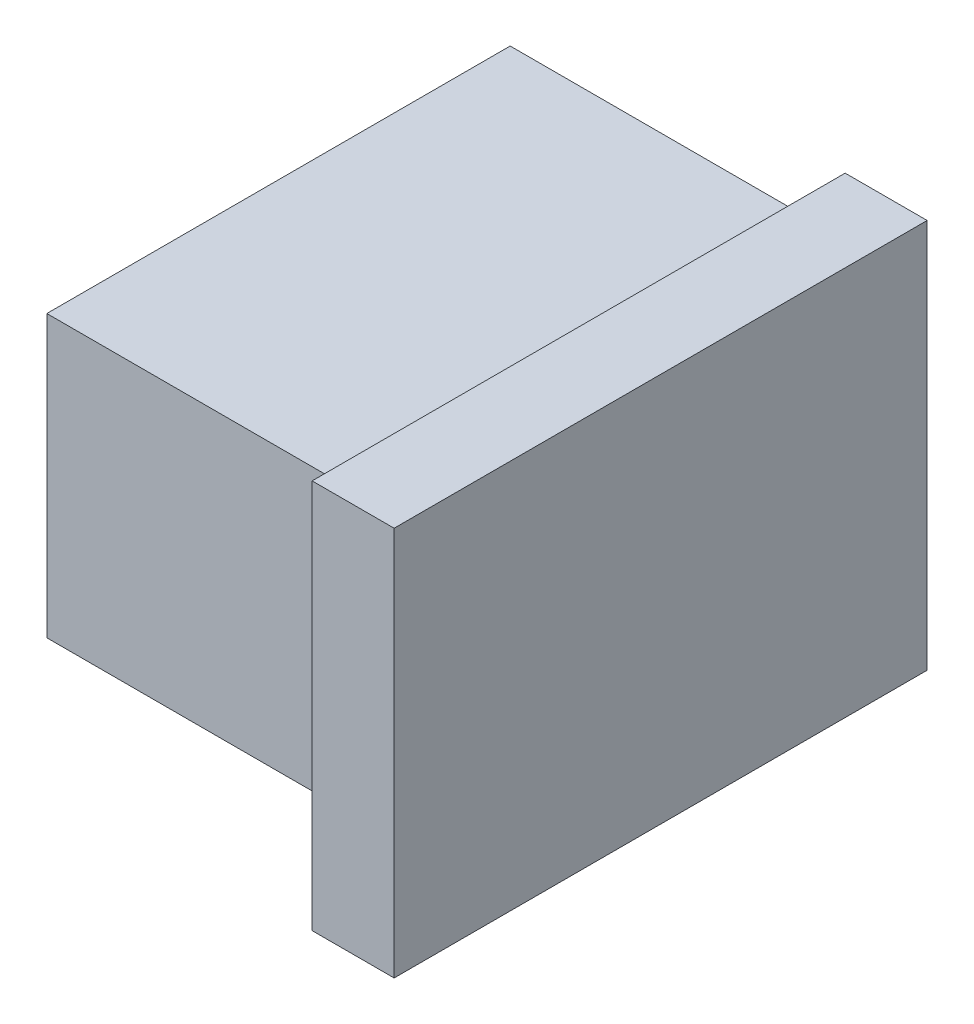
ISO-10303-21;
HEADER;
FILE_DESCRIPTION(('STEP AP214'),'2;1');
FILE_NAME('part.step','',(''),(''),'','','');
FILE_SCHEMA(('AUTOMOTIVE_DESIGN { 1 0 10303 214 1 1 1 1 }'));
ENDSEC;
DATA;
#1=APPLICATION_CONTEXT('core data for automotive mechanical design processes');
#2=APPLICATION_PROTOCOL_DEFINITION('international standard','automotive_design',2000,#1);
#3=PRODUCT_CONTEXT('',#1,'mechanical');
#4=PRODUCT('Part','Part','',(#3));
#5=PRODUCT_RELATED_PRODUCT_CATEGORY('part','',(#4));
#6=PRODUCT_DEFINITION_FORMATION('','',#4);
#7=PRODUCT_DEFINITION_CONTEXT('part definition',#1,'design');
#8=PRODUCT_DEFINITION('design','',#6,#7);
#9=PRODUCT_DEFINITION_SHAPE('','',#8);
#10=(LENGTH_UNIT() NAMED_UNIT(*) SI_UNIT(.MILLI.,.METRE.));
#11=(NAMED_UNIT(*) PLANE_ANGLE_UNIT() SI_UNIT($,.RADIAN.));
#12=(NAMED_UNIT(*) SI_UNIT($,.STERADIAN.) SOLID_ANGLE_UNIT());
#13=UNCERTAINTY_MEASURE_WITH_UNIT(LENGTH_MEASURE(1.E-05),#10,'distance_accuracy_value','');
#14=(GEOMETRIC_REPRESENTATION_CONTEXT(3) GLOBAL_UNCERTAINTY_ASSIGNED_CONTEXT((#13)) GLOBAL_UNIT_ASSIGNED_CONTEXT((#10,
#11,#12)) REPRESENTATION_CONTEXT('',''));
#15=CARTESIAN_POINT('',(0.,0.,0.));
#16=DIRECTION('',(0.,0.,1.));
#17=DIRECTION('',(1.,0.,0.));
#18=AXIS2_PLACEMENT_3D('',#15,#16,#17);
#19=CARTESIAN_POINT('',(7.32,0.,-5.65));
#20=DIRECTION('',(0.,0.,-1.));
#21=DIRECTION('',(0.,1.,0.));
#22=AXIS2_PLACEMENT_3D('',#19,#20,#21);
#23=PLANE('',#22);
#24=DIRECTION('',(-1.,0.,0.));
#25=VECTOR('',#24,1.);
#26=CARTESIAN_POINT('',(18.7258099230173,-2.65,-5.65));
#27=LINE('',#26,#25);
#28=CARTESIAN_POINT('',(7.32,-2.65,-5.65));
#29=VERTEX_POINT('',#28);
#30=CARTESIAN_POINT('',(0.,-2.65,-5.65));
#31=VERTEX_POINT('',#30);
#32=EDGE_CURVE('E128',#29,#31,#27,.T.);
#33=ORIENTED_EDGE('',*,*,#32,.T.);
#34=DIRECTION('',(0.,-1.,0.));
#35=VECTOR('',#34,1.);
#36=CARTESIAN_POINT('',(0.,0.,-5.65));
#37=LINE('',#36,#35);
#38=CARTESIAN_POINT('',(0.,4.2,-5.65));
#39=VERTEX_POINT('',#38);
#40=EDGE_CURVE('E135',#39,#31,#37,.T.);
#41=ORIENTED_EDGE('',*,*,#40,.F.);
#42=DIRECTION('',(-1.,0.,0.));
#43=VECTOR('',#42,1.);
#44=CARTESIAN_POINT('',(7.32,4.2,-5.65));
#45=LINE('',#44,#43);
#46=CARTESIAN_POINT('',(7.32,4.2,-5.65));
#47=VERTEX_POINT('',#46);
#48=EDGE_CURVE('E11',#47,#39,#45,.T.);
#49=ORIENTED_EDGE('',*,*,#48,.F.);
#50=DIRECTION('',(0.,-1.,0.));
#51=VECTOR('',#50,1.);
#52=CARTESIAN_POINT('',(7.32,0.,-5.65));
#53=LINE('',#52,#51);
#54=EDGE_CURVE('E155',#47,#29,#53,.T.);
#55=ORIENTED_EDGE('',*,*,#54,.T.);
#56=EDGE_LOOP('',(#33,#41,#49,#55));
#57=FACE_BOUND('',#56,.T.);
#58=ADVANCED_FACE('F39',(#57),#23,.T.);
#59=CARTESIAN_POINT('',(7.32,4.2,0.));
#60=DIRECTION('',(0.,1.,0.));
#61=DIRECTION('',(0.,0.,1.));
#62=AXIS2_PLACEMENT_3D('',#59,#60,#61);
#63=PLANE('',#62);
#64=DIRECTION('',(0.,0.,-1.));
#65=VECTOR('',#64,1.);
#66=CARTESIAN_POINT('',(0.,4.2,0.));
#67=LINE('',#66,#65);
#68=CARTESIAN_POINT('',(0.,4.2,5.65));
#69=VERTEX_POINT('',#68);
#70=EDGE_CURVE('E138',#69,#39,#67,.T.);
#71=ORIENTED_EDGE('',*,*,#70,.F.);
#72=DIRECTION('',(-1.,0.,0.));
#73=VECTOR('',#72,1.);
#74=CARTESIAN_POINT('',(7.32,4.2,5.65));
#75=LINE('',#74,#73);
#76=CARTESIAN_POINT('',(7.32,4.2,5.65));
#77=VERTEX_POINT('',#76);
#78=EDGE_CURVE('E49',#77,#69,#75,.T.);
#79=ORIENTED_EDGE('',*,*,#78,.F.);
#80=DIRECTION('',(0.,0.,-1.));
#81=VECTOR('',#80,1.);
#82=CARTESIAN_POINT('',(7.32,4.2,0.));
#83=LINE('',#82,#81);
#84=EDGE_CURVE('E151',#77,#47,#83,.T.);
#85=ORIENTED_EDGE('',*,*,#84,.T.);
#86=ORIENTED_EDGE('',*,*,#48,.T.);
#87=EDGE_LOOP('',(#71,#79,#85,#86));
#88=FACE_BOUND('',#87,.T.);
#89=ADVANCED_FACE('F174',(#88),#63,.T.);
#90=CARTESIAN_POINT('',(7.32,0.,5.65));
#91=DIRECTION('',(0.,0.,-1.));
#92=DIRECTION('',(0.,1.,0.));
#93=AXIS2_PLACEMENT_3D('',#90,#91,#92);
#94=PLANE('',#93);
#95=DIRECTION('',(0.,-1.,0.));
#96=VECTOR('',#95,1.);
#97=CARTESIAN_POINT('',(0.,0.,5.65));
#98=LINE('',#97,#96);
#99=CARTESIAN_POINT('',(0.,-2.65,5.65));
#100=VERTEX_POINT('',#99);
#101=EDGE_CURVE('E134',#69,#100,#98,.T.);
#102=ORIENTED_EDGE('',*,*,#101,.T.);
#103=DIRECTION('',(-1.,0.,0.));
#104=VECTOR('',#103,1.);
#105=CARTESIAN_POINT('',(18.7258099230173,-2.65,5.65));
#106=LINE('',#105,#104);
#107=CARTESIAN_POINT('',(7.32,-2.65,5.65));
#108=VERTEX_POINT('',#107);
#109=EDGE_CURVE('E120',#108,#100,#106,.T.);
#110=ORIENTED_EDGE('',*,*,#109,.F.);
#111=DIRECTION('',(0.,-1.,0.));
#112=VECTOR('',#111,1.);
#113=CARTESIAN_POINT('',(7.32,0.,5.65));
#114=LINE('',#113,#112);
#115=EDGE_CURVE('E146',#77,#108,#114,.T.);
#116=ORIENTED_EDGE('',*,*,#115,.F.);
#117=ORIENTED_EDGE('',*,*,#78,.T.);
#118=EDGE_LOOP('',(#102,#110,#116,#117));
#119=FACE_BOUND('',#118,.T.);
#120=ADVANCED_FACE('F137',(#119),#94,.F.);
#121=CARTESIAN_POINT('',(7.32,0.,0.));
#122=DIRECTION('',(-1.,0.,0.));
#123=DIRECTION('',(0.,0.,1.));
#124=AXIS2_PLACEMENT_3D('',#121,#122,#123);
#125=CYLINDRICAL_SURFACE('',#124,1.6);
#126=CARTESIAN_POINT('',(0.,0.,0.));
#127=DIRECTION('',(1.,0.,0.));
#128=DIRECTION('',(0.,0.,-1.));
#129=AXIS2_PLACEMENT_3D('',#126,#127,#128);
#130=CIRCLE('',#129,1.6);
#131=CARTESIAN_POINT('',(0.,-0.75,1.41332940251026));
#132=VERTEX_POINT('',#131);
#133=CARTESIAN_POINT('',(0.,0.75,1.41332940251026));
#134=VERTEX_POINT('',#133);
#135=EDGE_CURVE('E159',#132,#134,#130,.T.);
#136=ORIENTED_EDGE('',*,*,#135,.F.);
#137=DIRECTION('',(-1.,0.,0.));
#138=VECTOR('',#137,1.);
#139=CARTESIAN_POINT('',(7.32,-0.75,1.41332940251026));
#140=LINE('',#139,#138);
#141=CARTESIAN_POINT('',(7.32,-0.75,1.41332940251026));
#142=VERTEX_POINT('',#141);
#143=EDGE_CURVE('E43',#142,#132,#140,.T.);
#144=ORIENTED_EDGE('',*,*,#143,.F.);
#145=CARTESIAN_POINT('',(7.32,0.,0.));
#146=DIRECTION('',(1.,0.,0.));
#147=DIRECTION('',(0.,0.,-1.));
#148=AXIS2_PLACEMENT_3D('',#145,#146,#147);
#149=CIRCLE('',#148,1.6);
#150=CARTESIAN_POINT('',(7.32,0.75,1.41332940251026));
#151=VERTEX_POINT('',#150);
#152=EDGE_CURVE('E79',#142,#151,#149,.T.);
#153=ORIENTED_EDGE('',*,*,#152,.T.);
#154=DIRECTION('',(-1.,0.,0.));
#155=VECTOR('',#154,1.);
#156=CARTESIAN_POINT('',(7.32,0.75,1.41332940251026));
#157=LINE('',#156,#155);
#158=EDGE_CURVE('E145',#151,#134,#157,.T.);
#159=ORIENTED_EDGE('',*,*,#158,.T.);
#160=EDGE_LOOP('',(#136,#144,#153,#159));
#161=FACE_BOUND('',#160,.T.);
#162=ADVANCED_FACE('F41',(#161),#125,.F.);
#163=CARTESIAN_POINT('',(7.32,0.,1.41332940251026));
#164=DIRECTION('',(0.,0.,-1.));
#165=DIRECTION('',(-1.,0.,0.));
#166=AXIS2_PLACEMENT_3D('',#163,#164,#165);
#167=PLANE('',#166);
#168=DIRECTION('',(0.,-1.,0.));
#169=VECTOR('',#168,1.);
#170=CARTESIAN_POINT('',(0.,0.,1.41332940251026));
#171=LINE('',#170,#169);
#172=EDGE_CURVE('E161',#134,#132,#171,.T.);
#173=ORIENTED_EDGE('',*,*,#172,.F.);
#174=ORIENTED_EDGE('',*,*,#158,.F.);
#175=DIRECTION('',(0.,-1.,0.));
#176=VECTOR('',#175,1.);
#177=CARTESIAN_POINT('',(7.32,0.,1.41332940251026));
#178=LINE('',#177,#176);
#179=EDGE_CURVE('E140',#151,#142,#178,.T.);
#180=ORIENTED_EDGE('',*,*,#179,.T.);
#181=ORIENTED_EDGE('',*,*,#143,.T.);
#182=EDGE_LOOP('',(#173,#174,#180,#181));
#183=FACE_BOUND('',#182,.T.);
#184=ADVANCED_FACE('F167',(#183),#167,.T.);
#185=CARTESIAN_POINT('',(0.,0.,0.));
#186=DIRECTION('',(1.,0.,0.));
#187=DIRECTION('',(0.,0.,-1.));
#188=AXIS2_PLACEMENT_3D('',#185,#186,#187);
#189=PLANE('',#188);
#190=ORIENTED_EDGE('',*,*,#135,.T.);
#191=ORIENTED_EDGE('',*,*,#172,.T.);
#192=EDGE_LOOP('',(#190,#191));
#193=FACE_BOUND('',#192,.T.);
#194=ORIENTED_EDGE('',*,*,#40,.T.);
#195=DIRECTION('',(0.,0.,-1.));
#196=VECTOR('',#195,1.);
#197=CARTESIAN_POINT('',(0.,-2.65,-5.65));
#198=LINE('',#197,#196);
#199=EDGE_CURVE('E124',#100,#31,#198,.T.);
#200=ORIENTED_EDGE('',*,*,#199,.F.);
#201=ORIENTED_EDGE('',*,*,#101,.F.);
#202=ORIENTED_EDGE('',*,*,#70,.T.);
#203=EDGE_LOOP('',(#194,#200,#201,#202));
#204=FACE_BOUND('',#203,.T.);
#205=ADVANCED_FACE('F132',(#193,#204),#189,.F.);
#206=CARTESIAN_POINT('',(9.32,0.,0.));
#207=DIRECTION('',(-1.,0.,0.));
#208=DIRECTION('',(0.,0.,1.));
#209=AXIS2_PLACEMENT_3D('',#206,#207,#208);
#210=PLANE('',#209);
#211=DIRECTION('',(0.,-1.,0.));
#212=VECTOR('',#211,1.);
#213=CARTESIAN_POINT('',(9.32,-4.75,6.5));
#214=LINE('',#213,#212);
#215=CARTESIAN_POINT('',(9.32,4.75,6.5));
#216=VERTEX_POINT('',#215);
#217=CARTESIAN_POINT('',(9.32,-4.75,6.5));
#218=VERTEX_POINT('',#217);
#219=EDGE_CURVE('E320',#216,#218,#214,.T.);
#220=ORIENTED_EDGE('',*,*,#219,.T.);
#221=DIRECTION('',(0.,0.,-1.));
#222=VECTOR('',#221,1.);
#223=CARTESIAN_POINT('',(9.32,-4.75,6.5));
#224=LINE('',#223,#222);
#225=CARTESIAN_POINT('',(9.32,-4.75,-6.5));
#226=VERTEX_POINT('',#225);
#227=EDGE_CURVE('E335',#218,#226,#224,.T.);
#228=ORIENTED_EDGE('',*,*,#227,.T.);
#229=DIRECTION('',(0.,1.,0.));
#230=VECTOR('',#229,1.);
#231=CARTESIAN_POINT('',(9.32,-4.75,-6.5));
#232=LINE('',#231,#230);
#233=CARTESIAN_POINT('',(9.32,4.75,-6.5));
#234=VERTEX_POINT('',#233);
#235=EDGE_CURVE('E336',#226,#234,#232,.T.);
#236=ORIENTED_EDGE('',*,*,#235,.T.);
#237=DIRECTION('',(0.,0.,1.));
#238=VECTOR('',#237,1.);
#239=CARTESIAN_POINT('',(9.32,4.75,6.5));
#240=LINE('',#239,#238);
#241=EDGE_CURVE('E315',#234,#216,#240,.T.);
#242=ORIENTED_EDGE('',*,*,#241,.T.);
#243=EDGE_LOOP('',(#220,#228,#236,#242));
#244=FACE_BOUND('',#243,.T.);
#245=ADVANCED_FACE('F186',(#244),#210,.F.);
#246=CARTESIAN_POINT('',(9.32,4.75,6.5));
#247=DIRECTION('',(0.,-1.,0.));
#248=DIRECTION('',(0.,0.,-1.));
#249=AXIS2_PLACEMENT_3D('',#246,#247,#248);
#250=PLANE('',#249);
#251=DIRECTION('',(0.,0.,1.));
#252=VECTOR('',#251,1.);
#253=CARTESIAN_POINT('',(7.32,4.75,6.5));
#254=LINE('',#253,#252);
#255=CARTESIAN_POINT('',(7.32,4.75,-6.5));
#256=VERTEX_POINT('',#255);
#257=CARTESIAN_POINT('',(7.32,4.75,6.5));
#258=VERTEX_POINT('',#257);
#259=EDGE_CURVE('E305',#256,#258,#254,.T.);
#260=ORIENTED_EDGE('',*,*,#259,.T.);
#261=DIRECTION('',(-1.,0.,0.));
#262=VECTOR('',#261,1.);
#263=CARTESIAN_POINT('',(9.32,4.75,6.5));
#264=LINE('',#263,#262);
#265=EDGE_CURVE('E321',#216,#258,#264,.T.);
#266=ORIENTED_EDGE('',*,*,#265,.F.);
#267=ORIENTED_EDGE('',*,*,#241,.F.);
#268=DIRECTION('',(-1.,0.,0.));
#269=VECTOR('',#268,1.);
#270=CARTESIAN_POINT('',(9.32,4.75,-6.5));
#271=LINE('',#270,#269);
#272=EDGE_CURVE('E323',#234,#256,#271,.T.);
#273=ORIENTED_EDGE('',*,*,#272,.T.);
#274=EDGE_LOOP('',(#260,#266,#267,#273));
#275=FACE_BOUND('',#274,.T.);
#276=ADVANCED_FACE('F199',(#275),#250,.F.);
#277=CARTESIAN_POINT('',(9.32,-4.75,-6.5));
#278=DIRECTION('',(0.,0.,1.));
#279=DIRECTION('',(0.,-1.,0.));
#280=AXIS2_PLACEMENT_3D('',#277,#278,#279);
#281=PLANE('',#280);
#282=DIRECTION('',(0.,1.,0.));
#283=VECTOR('',#282,1.);
#284=CARTESIAN_POINT('',(7.32,-4.75,-6.5));
#285=LINE('',#284,#283);
#286=CARTESIAN_POINT('',(7.32,-4.75,-6.5));
#287=VERTEX_POINT('',#286);
#288=EDGE_CURVE('E311',#287,#256,#285,.T.);
#289=ORIENTED_EDGE('',*,*,#288,.T.);
#290=ORIENTED_EDGE('',*,*,#272,.F.);
#291=ORIENTED_EDGE('',*,*,#235,.F.);
#292=DIRECTION('',(-1.,0.,0.));
#293=VECTOR('',#292,1.);
#294=CARTESIAN_POINT('',(9.32,-4.75,-6.5));
#295=LINE('',#294,#293);
#296=EDGE_CURVE('E326',#226,#287,#295,.T.);
#297=ORIENTED_EDGE('',*,*,#296,.T.);
#298=EDGE_LOOP('',(#289,#290,#291,#297));
#299=FACE_BOUND('',#298,.T.);
#300=ADVANCED_FACE('F195',(#299),#281,.F.);
#301=CARTESIAN_POINT('',(9.32,-4.75,6.5));
#302=DIRECTION('',(0.,1.,0.));
#303=DIRECTION('',(0.,0.,1.));
#304=AXIS2_PLACEMENT_3D('',#301,#302,#303);
#305=PLANE('',#304);
#306=DIRECTION('',(0.,0.,-1.));
#307=VECTOR('',#306,1.);
#308=CARTESIAN_POINT('',(7.32,-4.75,6.5));
#309=LINE('',#308,#307);
#310=CARTESIAN_POINT('',(7.32,-4.75,6.5));
#311=VERTEX_POINT('',#310);
#312=EDGE_CURVE('E306',#311,#287,#309,.T.);
#313=ORIENTED_EDGE('',*,*,#312,.T.);
#314=ORIENTED_EDGE('',*,*,#296,.F.);
#315=ORIENTED_EDGE('',*,*,#227,.F.);
#316=DIRECTION('',(-1.,0.,0.));
#317=VECTOR('',#316,1.);
#318=CARTESIAN_POINT('',(9.32,-4.75,6.5));
#319=LINE('',#318,#317);
#320=EDGE_CURVE('E162',#218,#311,#319,.T.);
#321=ORIENTED_EDGE('',*,*,#320,.T.);
#322=EDGE_LOOP('',(#313,#314,#315,#321));
#323=FACE_BOUND('',#322,.T.);
#324=ADVANCED_FACE('F191',(#323),#305,.F.);
#325=CARTESIAN_POINT('',(9.32,-4.75,6.5));
#326=DIRECTION('',(0.,0.,-1.));
#327=DIRECTION('',(0.,1.,0.));
#328=AXIS2_PLACEMENT_3D('',#325,#326,#327);
#329=PLANE('',#328);
#330=DIRECTION('',(0.,-1.,0.));
#331=VECTOR('',#330,1.);
#332=CARTESIAN_POINT('',(7.32,-4.75,6.5));
#333=LINE('',#332,#331);
#334=EDGE_CURVE('E303',#258,#311,#333,.T.);
#335=ORIENTED_EDGE('',*,*,#334,.T.);
#336=ORIENTED_EDGE('',*,*,#320,.F.);
#337=ORIENTED_EDGE('',*,*,#219,.F.);
#338=ORIENTED_EDGE('',*,*,#265,.T.);
#339=EDGE_LOOP('',(#335,#336,#337,#338));
#340=FACE_BOUND('',#339,.T.);
#341=ADVANCED_FACE('F187',(#340),#329,.F.);
#342=CARTESIAN_POINT('',(7.32,0.,0.));
#343=DIRECTION('',(-1.,0.,0.));
#344=DIRECTION('',(0.,0.,1.));
#345=AXIS2_PLACEMENT_3D('',#342,#343,#344);
#346=PLANE('',#345);
#347=DIRECTION('',(0.,0.,1.));
#348=VECTOR('',#347,1.);
#349=CARTESIAN_POINT('',(7.32,-2.65,-5.65));
#350=LINE('',#349,#348);
#351=EDGE_CURVE('E126',#29,#108,#350,.T.);
#352=ORIENTED_EDGE('',*,*,#351,.F.);
#353=ORIENTED_EDGE('',*,*,#54,.F.);
#354=ORIENTED_EDGE('',*,*,#84,.F.);
#355=ORIENTED_EDGE('',*,*,#115,.T.);
#356=EDGE_LOOP('',(#352,#353,#354,#355));
#357=FACE_BOUND('',#356,.T.);
#358=ORIENTED_EDGE('',*,*,#334,.F.);
#359=ORIENTED_EDGE('',*,*,#259,.F.);
#360=ORIENTED_EDGE('',*,*,#288,.F.);
#361=ORIENTED_EDGE('',*,*,#312,.F.);
#362=EDGE_LOOP('',(#358,#359,#360,#361));
#363=FACE_BOUND('',#362,.T.);
#364=ADVANCED_FACE('F190',(#357,#363),#346,.T.);
#365=ORIENTED_EDGE('',*,*,#152,.F.);
#366=ORIENTED_EDGE('',*,*,#179,.F.);
#367=EDGE_LOOP('',(#365,#366));
#368=FACE_BOUND('',#367,.T.);
#369=ADVANCED_FACE('F204',(#368),#346,.T.);
#370=CARTESIAN_POINT('',(18.7258099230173,-2.65,-5.65));
#371=DIRECTION('',(0.,1.,0.));
#372=DIRECTION('',(0.,0.,1.));
#373=AXIS2_PLACEMENT_3D('',#370,#371,#372);
#374=PLANE('',#373);
#375=ORIENTED_EDGE('',*,*,#351,.T.);
#376=ORIENTED_EDGE('',*,*,#109,.T.);
#377=ORIENTED_EDGE('',*,*,#199,.T.);
#378=ORIENTED_EDGE('',*,*,#32,.F.);
#379=EDGE_LOOP('',(#375,#376,#377,#378));
#380=FACE_BOUND('',#379,.T.);
#381=ADVANCED_FACE('F122',(#380),#374,.F.);
#382=CLOSED_SHELL('',(#58,#89,#120,#162,#184,#205,#245,#276,#300,#324,#341,#364,#369,#381));
#383=MANIFOLD_SOLID_BREP('B2',#382);
#384=ADVANCED_BREP_SHAPE_REPRESENTATION('',(#18,#383),#14);
#385=SHAPE_DEFINITION_REPRESENTATION(#9,#384);
ENDSEC;
END-ISO-10303-21;
